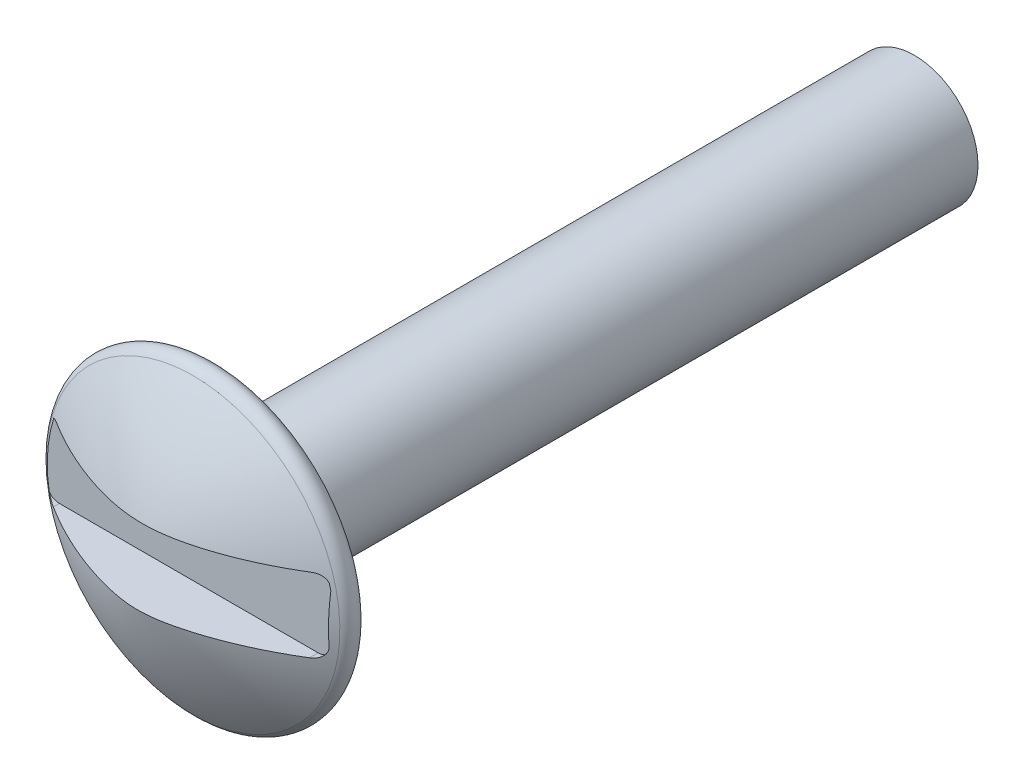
ISO-10303-21;
HEADER;
FILE_DESCRIPTION(('STEP AP214'),'2;1');
FILE_NAME('part.step','',(''),(''),'','','');
FILE_SCHEMA(('AUTOMOTIVE_DESIGN { 1 0 10303 214 1 1 1 1 }'));
ENDSEC;
DATA;
#1=APPLICATION_CONTEXT('core data for automotive mechanical design processes');
#2=APPLICATION_PROTOCOL_DEFINITION('international standard','automotive_design',2000,#1);
#3=PRODUCT_CONTEXT('',#1,'mechanical');
#4=PRODUCT('Part','Part','',(#3));
#5=PRODUCT_RELATED_PRODUCT_CATEGORY('part','',(#4));
#6=PRODUCT_DEFINITION_FORMATION('','',#4);
#7=PRODUCT_DEFINITION_CONTEXT('part definition',#1,'design');
#8=PRODUCT_DEFINITION('design','',#6,#7);
#9=PRODUCT_DEFINITION_SHAPE('','',#8);
#10=(LENGTH_UNIT() NAMED_UNIT(*) SI_UNIT(.MILLI.,.METRE.));
#11=(NAMED_UNIT(*) PLANE_ANGLE_UNIT() SI_UNIT($,.RADIAN.));
#12=(NAMED_UNIT(*) SI_UNIT($,.STERADIAN.) SOLID_ANGLE_UNIT());
#13=UNCERTAINTY_MEASURE_WITH_UNIT(LENGTH_MEASURE(1.E-05),#10,'distance_accuracy_value','');
#14=(GEOMETRIC_REPRESENTATION_CONTEXT(3) GLOBAL_UNCERTAINTY_ASSIGNED_CONTEXT((#13)) GLOBAL_UNIT_ASSIGNED_CONTEXT((#10,
#11,#12)) REPRESENTATION_CONTEXT('',''));
#15=CARTESIAN_POINT('',(0.,0.,0.));
#16=DIRECTION('',(0.,0.,1.));
#17=DIRECTION('',(1.,0.,0.));
#18=AXIS2_PLACEMENT_3D('',#15,#16,#17);
#19=CARTESIAN_POINT('',(0.,0.,55.));
#20=DIRECTION('',(0.,0.,-1.));
#21=DIRECTION('',(-1.,0.,0.));
#22=AXIS2_PLACEMENT_3D('',#19,#20,#21);
#23=CYLINDRICAL_SURFACE('',#22,5.);
#24=CARTESIAN_POINT('',(0.,0.,55.));
#25=DIRECTION('',(0.,0.,1.));
#26=DIRECTION('',(1.,0.,0.));
#27=AXIS2_PLACEMENT_3D('',#24,#25,#26);
#28=CIRCLE('',#27,5.);
#29=CARTESIAN_POINT('',(5.,0.,55.));
#30=VERTEX_POINT('',#29);
#31=EDGE_CURVE('E220',#30,#30,#28,.T.);
#32=ORIENTED_EDGE('',*,*,#31,.F.);
#33=EDGE_LOOP('',(#32));
#34=FACE_BOUND('',#33,.T.);
#35=CARTESIAN_POINT('',(0.,0.,0.));
#36=DIRECTION('',(0.,0.,1.));
#37=DIRECTION('',(1.,0.,0.));
#38=AXIS2_PLACEMENT_3D('',#35,#36,#37);
#39=CIRCLE('',#38,5.);
#40=CARTESIAN_POINT('',(5.,0.,0.));
#41=VERTEX_POINT('',#40);
#42=EDGE_CURVE('E223',#41,#41,#39,.T.);
#43=ORIENTED_EDGE('',*,*,#42,.T.);
#44=EDGE_LOOP('',(#43));
#45=FACE_BOUND('',#44,.T.);
#46=ADVANCED_FACE('F32',(#34,#45),#23,.T.);
#47=CARTESIAN_POINT('',(0.,0.,0.));
#48=DIRECTION('',(0.,0.,1.));
#49=DIRECTION('',(1.,0.,0.));
#50=AXIS2_PLACEMENT_3D('',#47,#48,#49);
#51=PLANE('',#50);
#52=ORIENTED_EDGE('',*,*,#42,.F.);
#53=EDGE_LOOP('',(#52));
#54=FACE_BOUND('',#53,.T.);
#55=ADVANCED_FACE('F154',(#54),#51,.F.);
#56=CARTESIAN_POINT('',(0.,0.,55.));
#57=DIRECTION('',(0.,0.,-1.));
#58=DIRECTION('',(-1.,0.,0.));
#59=AXIS2_PLACEMENT_3D('',#56,#57,#58);
#60=PLANE('',#59);
#61=CARTESIAN_POINT('',(0.,0.,55.));
#62=DIRECTION('',(0.,0.,-1.));
#63=DIRECTION('',(-1.,0.,0.));
#64=AXIS2_PLACEMENT_3D('',#61,#62,#63);
#65=CIRCLE('',#64,10.9901594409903);
#66=CARTESIAN_POINT('',(-10.9901594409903,0.,55.));
#67=VERTEX_POINT('',#66);
#68=EDGE_CURVE('E224',#67,#67,#65,.T.);
#69=ORIENTED_EDGE('',*,*,#68,.T.);
#70=EDGE_LOOP('',(#69));
#71=FACE_BOUND('',#70,.T.);
#72=ORIENTED_EDGE('',*,*,#31,.T.);
#73=EDGE_LOOP('',(#72));
#74=FACE_BOUND('',#73,.T.);
#75=ADVANCED_FACE('F151',(#71,#74),#60,.T.);
#76=CARTESIAN_POINT('',(0.,11.5642425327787,56.8187970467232));
#77=CARTESIAN_POINT('',(0.,8.07794332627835,59.2631456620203));
#78=CARTESIAN_POINT('',(0.,4.18300109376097,60.9035240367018));
#79=CARTESIAN_POINT('',(0.,0.,61.6895171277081));
#80=B_SPLINE_CURVE_WITH_KNOTS('',3,(#76,#77,#78,#79),.UNSPECIFIED.,.F.,.F.,(4,4),(0.,
0.812856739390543),.UNSPECIFIED.);
#81=CARTESIAN_POINT('',(0.,0.,49.7533353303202));
#82=DIRECTION('',(0.,0.,-1.));
#83=AXIS1_PLACEMENT('',#81,#82);
#84=SURFACE_OF_REVOLUTION('',#80,#83);
#85=CARTESIAN_POINT('',(10.0302950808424,-2.24099313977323,57.6728208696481));
#86=CARTESIAN_POINT('',(10.1027244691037,-2.24100761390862,57.6284671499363));
#87=CARTESIAN_POINT('',(10.175615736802,-2.23311010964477,57.5844784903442));
#88=CARTESIAN_POINT('',(10.3199524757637,-2.2010018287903,57.4986892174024));
#89=CARTESIAN_POINT('',(10.3913787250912,-2.17664308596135,57.4569121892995));
#90=CARTESIAN_POINT('',(10.5196299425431,-2.11556409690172,57.3832531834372));
#91=CARTESIAN_POINT('',(10.5771197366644,-2.08097495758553,57.3507981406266));
#92=CARTESIAN_POINT('',(10.6582586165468,-2.01996909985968,57.3059288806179));
#93=CARTESIAN_POINT('',(10.6844057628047,-1.99816900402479,57.2916341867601));
#94=CARTESIAN_POINT('',(10.73475419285,-1.95156661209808,57.2644617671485));
#95=CARTESIAN_POINT('',(10.7589534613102,-1.92676127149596,57.251585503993));
#96=CARTESIAN_POINT('',(10.814730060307,-1.86318687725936,57.2223935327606));
#97=CARTESIAN_POINT('',(10.8451035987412,-1.8229467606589,57.2069238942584));
#98=CARTESIAN_POINT('',(10.8998569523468,-1.73741626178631,57.1800196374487));
#99=CARTESIAN_POINT('',(10.9242443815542,-1.69213240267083,57.1685798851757));
#100=CARTESIAN_POINT('',(10.9661085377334,-1.59729943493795,57.150231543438));
#101=CARTESIAN_POINT('',(10.9835471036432,-1.54772854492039,57.1433478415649));
#102=CARTESIAN_POINT('',(11.0104438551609,-1.44607937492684,57.1346286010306));
#103=CARTESIAN_POINT('',(11.0199160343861,-1.39400566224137,57.1327841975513));
#104=CARTESIAN_POINT('',(11.0269143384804,-1.32487663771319,57.1337307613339));
#105=CARTESIAN_POINT('',(11.0281837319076,-1.30809200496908,57.1342222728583));
#106=CARTESIAN_POINT('',(11.029872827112,-1.2745322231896,57.1357219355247));
#107=CARTESIAN_POINT('',(11.0302939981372,-1.25775710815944,57.1367291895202));
#108=CARTESIAN_POINT('',(11.0302950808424,-1.24099313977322,57.1379913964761));
#109=B_SPLINE_CURVE_WITH_KNOTS('',3,(#85,#86,#87,#88,#89,#90,#91,#92,#93,#94,#95,#96,#97,#98,
#99,#100,#101,#102,#103,#104,#105,#106,#107,#108),.UNSPECIFIED.,.F.,.F.,(4,2,2,2,2,2,2,2,2,2,2,
4),(0.,0.254756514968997,0.511833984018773,0.733956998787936,0.844552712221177,
0.955261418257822,1.11275558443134,1.27004837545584,1.42819344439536,1.58606013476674,
1.63655848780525,1.68696929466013),.UNSPECIFIED.);
#110=CARTESIAN_POINT('',(10.0302950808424,-2.24099313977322,57.6728208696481));
#111=VERTEX_POINT('',#110);
#112=CARTESIAN_POINT('',(11.0302950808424,-1.24099313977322,57.1379913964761));
#113=VERTEX_POINT('',#112);
#114=EDGE_CURVE('E11',#111,#113,#109,.T.);
#115=ORIENTED_EDGE('',*,*,#114,.F.);
#116=CARTESIAN_POINT('',(-10.3450277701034,-2.24099313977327,57.477347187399));
#117=CARTESIAN_POINT('',(-10.2081855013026,-2.24099313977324,57.5635398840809));
#118=CARTESIAN_POINT('',(-10.070630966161,-2.24099313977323,57.6486023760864));
#119=CARTESIAN_POINT('',(-9.79411142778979,-2.24099313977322,57.8164371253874));
#120=CARTESIAN_POINT('',(-9.65514627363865,-2.24099313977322,57.8992091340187));
#121=CARTESIAN_POINT('',(-9.37584009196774,-2.24099313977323,58.0624197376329));
#122=CARTESIAN_POINT('',(-9.23549897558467,-2.24099313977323,58.142858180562));
#123=CARTESIAN_POINT('',(-8.95347613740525,-2.24099313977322,58.3013590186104));
#124=CARTESIAN_POINT('',(-8.81179437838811,-2.24099313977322,58.3794213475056));
#125=CARTESIAN_POINT('',(-8.52433162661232,-2.24099313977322,58.5346361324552));
#126=CARTESIAN_POINT('',(-8.37852475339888,-2.24099313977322,58.6117406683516));
#127=CARTESIAN_POINT('',(-8.08559007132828,-2.24099313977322,58.7633907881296));
#128=CARTESIAN_POINT('',(-7.93846228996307,-2.24099313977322,58.8379364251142));
#129=CARTESIAN_POINT('',(-7.6429210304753,-2.24099313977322,58.9844231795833));
#130=CARTESIAN_POINT('',(-7.49450759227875,-2.24099313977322,59.0563643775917));
#131=CARTESIAN_POINT('',(-7.19643048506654,-2.24099313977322,59.1975938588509));
#132=CARTESIAN_POINT('',(-7.04676685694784,-2.24099313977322,59.2668822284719));
#133=CARTESIAN_POINT('',(-6.68471239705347,-2.24099313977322,59.4305629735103));
#134=CARTESIAN_POINT('',(-6.47171775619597,-2.24099313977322,59.5236239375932));
#135=CARTESIAN_POINT('',(-6.04337764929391,-2.24099313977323,59.7042198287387));
#136=CARTESIAN_POINT('',(-5.82803198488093,-2.24099313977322,59.7917542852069));
#137=CARTESIAN_POINT('',(-5.39504907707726,-2.24099313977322,59.9610972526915));
#138=CARTESIAN_POINT('',(-5.17741138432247,-2.24099313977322,60.0429046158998));
#139=CARTESIAN_POINT('',(-4.73987819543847,-2.24099313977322,60.2005247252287));
#140=CARTESIAN_POINT('',(-4.51998186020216,-2.24099313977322,60.2763351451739));
#141=CARTESIAN_POINT('',(-4.08099382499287,-2.24099313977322,60.4205630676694));
#142=CARTESIAN_POINT('',(-3.86192994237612,-2.24099313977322,60.4890650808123));
#143=CARTESIAN_POINT('',(-3.42177951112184,-2.24099313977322,60.6192096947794));
#144=CARTESIAN_POINT('',(-3.20069308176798,-2.24099313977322,60.6808526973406));
#145=CARTESIAN_POINT('',(-2.75651203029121,-2.24099313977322,60.7963190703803));
#146=CARTESIAN_POINT('',(-2.53341771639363,-2.24099313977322,60.8501436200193));
#147=CARTESIAN_POINT('',(-2.08505013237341,-2.24099313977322,60.9484219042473));
#148=CARTESIAN_POINT('',(-1.85977609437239,-2.24099313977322,60.9928722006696));
#149=CARTESIAN_POINT('',(-1.46572325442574,-2.24099313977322,61.0597949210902));
#150=CARTESIAN_POINT('',(-1.29740889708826,-2.24099313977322,61.0849781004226));
#151=CARTESIAN_POINT('',(-0.959817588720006,-2.24099313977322,61.1272454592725));
#152=CARTESIAN_POINT('',(-0.79054111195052,-2.24099313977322,61.1443333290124));
#153=CARTESIAN_POINT('',(-0.451486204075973,-2.24099313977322,61.1689005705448));
#154=CARTESIAN_POINT('',(-0.281708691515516,-2.24099313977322,61.176392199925));
#155=CARTESIAN_POINT('',(0.0578063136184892,-2.24099313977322,61.1809329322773));
#156=CARTESIAN_POINT('',(0.227543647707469,-2.24099313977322,61.1779934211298));
#157=CARTESIAN_POINT('',(0.568259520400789,-2.24099313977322,61.1619750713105));
#158=CARTESIAN_POINT('',(0.739233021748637,-2.24099313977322,61.1487929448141));
#159=CARTESIAN_POINT('',(1.08046960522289,-2.24099313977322,61.1135071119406));
#160=CARTESIAN_POINT('',(1.25073136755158,-2.24099313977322,61.0913910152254));
#161=CARTESIAN_POINT('',(1.59038748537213,-2.24099313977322,61.0397851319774));
#162=CARTESIAN_POINT('',(1.75978005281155,-2.24099313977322,61.0102837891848));
#163=CARTESIAN_POINT('',(2.09750699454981,-2.24099313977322,60.9452119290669));
#164=CARTESIAN_POINT('',(2.26584051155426,-2.24099313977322,60.9096370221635));
#165=CARTESIAN_POINT('',(2.70645974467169,-2.24099313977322,60.8095248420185));
#166=CARTESIAN_POINT('',(2.97779605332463,-2.24099313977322,60.7408064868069));
#167=CARTESIAN_POINT('',(3.51722808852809,-2.24099313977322,60.5925226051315));
#168=CARTESIAN_POINT('',(3.78532610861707,-2.24099313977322,60.5129653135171));
#169=CARTESIAN_POINT('',(4.31846254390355,-2.24099313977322,60.3442848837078));
#170=CARTESIAN_POINT('',(4.58350122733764,-2.24099313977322,60.2551625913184));
#171=CARTESIAN_POINT('',(5.11048403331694,-2.24099313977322,60.068117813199));
#172=CARTESIAN_POINT('',(5.37242777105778,-2.24099313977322,59.9701942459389));
#173=CARTESIAN_POINT('',(5.89309525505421,-2.24099313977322,59.7660367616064));
#174=CARTESIAN_POINT('',(6.15181854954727,-2.24099313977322,59.6598016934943));
#175=CARTESIAN_POINT('',(6.65927577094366,-2.24099313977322,59.4422055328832));
#176=CARTESIAN_POINT('',(6.90809588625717,-2.24099313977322,59.3310452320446));
#177=CARTESIAN_POINT('',(7.40230194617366,-2.24099313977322,59.1014541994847));
#178=CARTESIAN_POINT('',(7.6476885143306,-2.24099313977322,58.9830248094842));
#179=CARTESIAN_POINT('',(8.13477750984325,-2.24099313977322,58.7391660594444));
#180=CARTESIAN_POINT('',(8.37648201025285,-2.24099313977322,58.6137408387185));
#181=CARTESIAN_POINT('',(8.85595462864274,-2.24099313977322,58.3561579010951));
#182=CARTESIAN_POINT('',(9.0937265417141,-2.24099313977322,58.2240072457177));
#183=CARTESIAN_POINT('',(9.56508681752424,-2.24099313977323,57.9532473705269));
#184=CARTESIAN_POINT('',(9.79868095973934,-2.24099313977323,57.8146482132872));
#185=CARTESIAN_POINT('',(10.0302950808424,-2.24099313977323,57.6728208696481));
#186=B_SPLINE_CURVE_WITH_KNOTS('',3,(#116,#117,#118,#119,#120,#121,#122,#123,#124,#125,#126,
#127,#128,#129,#130,#131,#132,#133,#134,#135,#136,#137,#138,#139,#140,#141,#142,#143,#144,#145,
#146,#147,#148,#149,#150,#151,#152,#153,#154,#155,#156,#157,#158,#159,#160,#161,#162,#163,#164,
#165,#166,#167,#168,#169,#170,#171,#172,#173,#174,#175,#176,#177,#178,#179,#180,#181,#182,#183,
#184,#185),.UNSPECIFIED.,.F.,.F.,(4,2,2,2,2,2,2,2,2,2,2,2,2,2,2,2,2,2,2,2,2,2,2,2,2,2,2,2,2,2,2,
2,2,2,4),(0.,0.48517007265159,0.970392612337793,1.45564669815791,1.94091429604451,
2.43570513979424,2.93048570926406,3.42525096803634,3.92000010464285,4.6172319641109,
5.31452311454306,6.01195361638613,6.70965333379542,7.39812616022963,8.08655864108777,
8.77488718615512,9.46346775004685,9.97387651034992,10.484052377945,10.9935759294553,
11.5025434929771,12.0167112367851,12.5315945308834,13.0472885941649,13.5633569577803,
14.4027622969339,15.2415334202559,16.0802304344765,16.9190306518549,17.7579472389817,
18.575392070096,19.3926864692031,20.2095023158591,21.0254775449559,21.8402196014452),.UNSPECIFIED.);
#187=CARTESIAN_POINT('',(-10.3450277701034,-2.24099313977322,57.477347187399));
#188=VERTEX_POINT('',#187);
#189=EDGE_CURVE('E44',#188,#111,#186,.T.);
#190=ORIENTED_EDGE('',*,*,#189,.F.);
#191=CARTESIAN_POINT('',(-11.1539558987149,-1.82890068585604,57.));
#192=CARTESIAN_POINT('',(-11.1194214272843,-1.87645931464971,57.0180915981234));
#193=CARTESIAN_POINT('',(-11.0812490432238,-1.92014288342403,57.0387594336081));
#194=CARTESIAN_POINT('',(-10.9995687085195,-1.99912584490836,57.0840834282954));
#195=CARTESIAN_POINT('',(-10.9560972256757,-2.0344781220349,57.1087126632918));
#196=CARTESIAN_POINT('',(-10.8654329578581,-2.09667919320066,57.160960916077));
#197=CARTESIAN_POINT('',(-10.818254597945,-2.12355909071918,57.1885684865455));
#198=CARTESIAN_POINT('',(-10.7212313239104,-2.16908122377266,57.2460981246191));
#199=CARTESIAN_POINT('',(-10.6713797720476,-2.18770177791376,57.2760260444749));
#200=CARTESIAN_POINT('',(-10.5754206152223,-2.21523822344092,57.3342847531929));
#201=CARTESIAN_POINT('',(-10.5294471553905,-2.22494783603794,57.3624689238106));
#202=CARTESIAN_POINT('',(-10.4372803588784,-2.23780917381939,57.4194957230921));
#203=CARTESIAN_POINT('',(-10.39108895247,-2.24099031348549,57.448334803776));
#204=CARTESIAN_POINT('',(-10.3450277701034,-2.24099313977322,57.477347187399));
#205=B_SPLINE_CURVE_WITH_KNOTS('',3,(#191,#192,#193,#194,#195,#196,#197,#198,#199,#200,#201,
#202,#203,#204),.UNSPECIFIED.,.F.,.F.,(4,2,2,2,2,2,4),(0.,0.183929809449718,0.366658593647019,
0.548708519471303,0.731233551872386,0.895215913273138,1.05845780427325),.UNSPECIFIED.);
#206=CARTESIAN_POINT('',(-11.1539558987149,-1.82890068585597,57.));
#207=VERTEX_POINT('',#206);
#208=EDGE_CURVE('E110',#207,#188,#205,.T.);
#209=ORIENTED_EDGE('',*,*,#208,.F.);
#210=CARTESIAN_POINT('',(0.,0.,57.));
#211=DIRECTION('',(0.,0.,-1.));
#212=DIRECTION('',(-1.,0.,0.));
#213=AXIS2_PLACEMENT_3D('',#210,#211,#212);
#214=CIRCLE('',#213,11.3029027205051);
#215=CARTESIAN_POINT('',(-10.7890090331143,3.36940558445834,57.));
#216=VERTEX_POINT('',#215);
#217=EDGE_CURVE('E102',#216,#207,#214,.F.);
#218=ORIENTED_EDGE('',*,*,#217,.F.);
#219=CARTESIAN_POINT('',(-10.3450277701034,3.47336951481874,57.2632014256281));
#220=CARTESIAN_POINT('',(-10.4066102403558,3.47340252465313,57.2244897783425));
#221=CARTESIAN_POINT('',(-10.468791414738,3.46767609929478,57.1862857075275));
#222=CARTESIAN_POINT('',(-10.5912029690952,3.44455191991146,57.1128809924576));
#223=CARTESIAN_POINT('',(-10.6514484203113,3.42736142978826,57.0776393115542));
#224=CARTESIAN_POINT('',(-10.7235456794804,3.39907314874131,57.0366320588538));
#225=CARTESIAN_POINT('',(-10.7367206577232,3.39357717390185,57.0291878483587));
#226=CARTESIAN_POINT('',(-10.7629637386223,3.38195957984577,57.0144610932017));
#227=CARTESIAN_POINT('',(-10.7760311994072,3.37583553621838,57.0071793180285));
#228=CARTESIAN_POINT('',(-10.7890090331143,3.36940558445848,57.));
#229=B_SPLINE_CURVE_WITH_KNOTS('',3,(#219,#220,#221,#222,#223,#224,#225,#226,#227,#228),
.UNSPECIFIED.,.F.,.F.,(4,2,2,2,4),(0.,0.21840244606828,0.432959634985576,0.48124941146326,
0.529733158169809),.UNSPECIFIED.);
#230=CARTESIAN_POINT('',(-10.3450277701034,3.47336951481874,57.2632014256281));
#231=VERTEX_POINT('',#230);
#232=EDGE_CURVE('E180',#231,#216,#229,.T.);
#233=ORIENTED_EDGE('',*,*,#232,.F.);
#234=CARTESIAN_POINT('',(10.0302950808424,3.47336951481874,57.4581864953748));
#235=CARTESIAN_POINT('',(9.84583517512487,3.47336951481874,57.5708112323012));
#236=CARTESIAN_POINT('',(9.66008953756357,3.47336951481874,57.6813336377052));
#237=CARTESIAN_POINT('',(9.28606907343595,3.47336951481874,57.8980676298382));
#238=CARTESIAN_POINT('',(9.09779393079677,3.47336951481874,58.0042786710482));
#239=CARTESIAN_POINT('',(8.71879494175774,3.47336951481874,58.2122598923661));
#240=CARTESIAN_POINT('',(8.52807098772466,3.47336951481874,58.3140298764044));
#241=CARTESIAN_POINT('',(8.14086022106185,3.47336951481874,58.5147512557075));
#242=CARTESIAN_POINT('',(7.94433112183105,3.47336951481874,58.6136211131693));
#243=CARTESIAN_POINT('',(7.54889339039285,3.47336951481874,58.806468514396));
#244=CARTESIAN_POINT('',(7.34998483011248,3.47336951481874,58.9004462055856));
#245=CARTESIAN_POINT('',(6.94985640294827,3.47336951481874,59.083340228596));
#246=CARTESIAN_POINT('',(6.74863656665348,3.47336951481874,59.1722566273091));
#247=CARTESIAN_POINT('',(6.3355895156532,3.47336951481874,59.3483949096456));
#248=CARTESIAN_POINT('',(6.12366757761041,3.47336951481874,59.4353949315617));
#249=CARTESIAN_POINT('',(5.69744281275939,3.47336951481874,59.6034212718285));
#250=CARTESIAN_POINT('',(5.48313976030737,3.47336951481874,59.684447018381));
#251=CARTESIAN_POINT('',(5.05218901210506,3.47336951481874,59.8401796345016));
#252=CARTESIAN_POINT('',(4.83554077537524,3.47336951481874,59.9148850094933));
#253=CARTESIAN_POINT('',(4.39989580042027,3.47336951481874,60.0575244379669));
#254=CARTESIAN_POINT('',(4.18089789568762,3.47336951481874,60.1254549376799));
#255=CARTESIAN_POINT('',(3.74315382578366,3.47336951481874,60.2531547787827));
#256=CARTESIAN_POINT('',(3.52443164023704,3.47336951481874,60.3130060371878));
#257=CARTESIAN_POINT('',(3.08493441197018,3.47336951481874,60.4245757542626));
#258=CARTESIAN_POINT('',(2.86415958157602,3.47336951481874,60.4762950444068));
#259=CARTESIAN_POINT('',(2.4207484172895,3.47336951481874,60.5704555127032));
#260=CARTESIAN_POINT('',(2.19811315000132,3.47336951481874,60.6129016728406));
#261=CARTESIAN_POINT('',(1.7511089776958,3.47336951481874,60.6871075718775));
#262=CARTESIAN_POINT('',(1.52674061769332,3.47336951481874,60.7188705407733));
#263=CARTESIAN_POINT('',(1.11216765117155,3.47336951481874,60.7660897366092));
#264=CARTESIAN_POINT('',(0.922167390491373,3.47336951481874,60.7833296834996));
#265=CARTESIAN_POINT('',(0.541507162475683,3.47336951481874,60.8083089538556));
#266=CARTESIAN_POINT('',(0.350847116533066,3.47336951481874,60.8160471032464));
#267=CARTESIAN_POINT('',(-0.0305858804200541,3.47336951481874,60.8215875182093));
#268=CARTESIAN_POINT('',(-0.221358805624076,3.47336951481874,60.819391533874));
#269=CARTESIAN_POINT('',(-0.602462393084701,3.47336951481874,60.8051971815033));
#270=CARTESIAN_POINT('',(-0.792793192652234,3.47336951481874,60.7932024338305));
#271=CARTESIAN_POINT('',(-1.1746266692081,3.47336951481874,60.759871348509));
#272=CARTESIAN_POINT('',(-1.36612081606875,3.47336951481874,60.7384387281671));
#273=CARTESIAN_POINT('',(-1.74802571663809,3.47336951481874,60.6871349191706));
#274=CARTESIAN_POINT('',(-1.93843608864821,3.47336951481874,60.657260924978));
#275=CARTESIAN_POINT('',(-2.3180275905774,3.47336951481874,60.5900257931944));
#276=CARTESIAN_POINT('',(-2.50720798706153,3.47336951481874,60.5526605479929));
#277=CARTESIAN_POINT('',(-2.88417181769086,3.47336951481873,60.4712939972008));
#278=CARTESIAN_POINT('',(-3.07195489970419,3.47336951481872,60.4272910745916));
#279=CARTESIAN_POINT('',(-3.57716294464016,3.47336951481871,60.3004365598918));
#280=CARTESIAN_POINT('',(-3.89318667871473,3.47336951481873,60.211975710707));
#281=CARTESIAN_POINT('',(-4.52068525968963,3.47336951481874,60.0203879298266));
#282=CARTESIAN_POINT('',(-4.83216039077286,3.47336951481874,59.9172619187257));
#283=CARTESIAN_POINT('',(-5.45055552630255,3.47336951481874,59.6978275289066));
#284=CARTESIAN_POINT('',(-5.75747373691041,3.47336951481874,59.5815141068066));
#285=CARTESIAN_POINT('',(-6.36653933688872,3.47336951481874,59.336727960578));
#286=CARTESIAN_POINT('',(-6.66868496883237,3.47336951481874,59.2082508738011));
#287=CARTESIAN_POINT('',(-7.26033026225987,3.47336951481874,58.9432858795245));
#288=CARTESIAN_POINT('',(-7.54995682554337,3.47336951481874,58.8070808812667));
#289=CARTESIAN_POINT('',(-8.12402110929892,3.47336951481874,58.5244367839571));
#290=CARTESIAN_POINT('',(-8.40846090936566,3.47336951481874,58.3780019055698));
#291=CARTESIAN_POINT('',(-8.97173354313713,3.47336951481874,58.075465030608));
#292=CARTESIAN_POINT('',(-9.25057234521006,3.47336951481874,57.9193741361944));
#293=CARTESIAN_POINT('',(-9.80222281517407,3.47336951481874,57.5980779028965));
#294=CARTESIAN_POINT('',(-10.075045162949,3.47336951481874,57.4328909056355));
#295=CARTESIAN_POINT('',(-10.3450277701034,3.47336951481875,57.2632014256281));
#296=B_SPLINE_CURVE_WITH_KNOTS('',3,(#234,#235,#236,#237,#238,#239,#240,#241,#242,#243,#244,
#245,#246,#247,#248,#249,#250,#251,#252,#253,#254,#255,#256,#257,#258,#259,#260,#261,#262,#263,
#264,#265,#266,#267,#268,#269,#270,#271,#272,#273,#274,#275,#276,#277,#278,#279,#280,#281,#282,
#283,#284,#285,#286,#287,#288,#289,#290,#291,#292,#293,#294,#295),.UNSPECIFIED.,.F.,.F.,(4,2,2,
2,2,2,2,2,2,2,2,2,2,2,2,2,2,2,2,2,2,2,2,2,2,2,2,2,2,2,4),(0.,0.648362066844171,1.29680591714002,
1.94527836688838,2.60520505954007,3.26511185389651,3.92500992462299,4.61217743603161,
5.29941063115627,5.98680588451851,6.6745598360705,7.35471093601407,8.03479244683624,
8.71450768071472,9.39401722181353,9.96614415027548,10.5383417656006,11.1104385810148,
11.6823241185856,12.2601841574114,12.8382364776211,13.4166066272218,13.99511790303,
14.9791802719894,15.963180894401,16.9475591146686,17.932291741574,18.8922466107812,
19.8518077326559,20.8102853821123,21.7668964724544),.UNSPECIFIED.);
#297=CARTESIAN_POINT('',(10.0302950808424,3.47336951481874,57.4581864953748));
#298=VERTEX_POINT('',#297);
#299=EDGE_CURVE('E59',#298,#231,#296,.T.);
#300=ORIENTED_EDGE('',*,*,#299,.F.);
#301=CARTESIAN_POINT('',(10.9129111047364,2.94346413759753,57.));
#302=CARTESIAN_POINT('',(10.9002214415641,2.96729290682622,57.0041457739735));
#303=CARTESIAN_POINT('',(10.8866193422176,2.9905009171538,57.0089399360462));
#304=CARTESIAN_POINT('',(10.8577522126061,3.035534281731,57.0197479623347));
#305=CARTESIAN_POINT('',(10.842488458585,3.05736067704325,57.0257608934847));
#306=CARTESIAN_POINT('',(10.7946350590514,3.12032102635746,57.0454333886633));
#307=CARTESIAN_POINT('',(10.7598056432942,3.15926489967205,57.0607854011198));
#308=CARTESIAN_POINT('',(10.6857037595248,3.23038739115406,57.095213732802));
#309=CARTESIAN_POINT('',(10.6464439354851,3.26258454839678,57.1142795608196));
#310=CARTESIAN_POINT('',(10.5645821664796,3.32015483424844,57.1554783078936));
#311=CARTESIAN_POINT('',(10.5219746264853,3.34551621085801,57.1776164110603));
#312=CARTESIAN_POINT('',(10.4299744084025,3.39161549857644,57.2267316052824));
#313=CARTESIAN_POINT('',(10.3803396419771,3.41158557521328,57.2539727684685));
#314=CARTESIAN_POINT('',(10.2797077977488,3.4432024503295,57.3105566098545));
#315=CARTESIAN_POINT('',(10.2287112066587,3.45485218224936,57.3398985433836));
#316=CARTESIAN_POINT('',(10.1284681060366,3.46977446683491,57.3988017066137));
#317=CARTESIAN_POINT('',(10.0792357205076,3.47337136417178,57.4283044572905));
#318=CARTESIAN_POINT('',(10.0302950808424,3.47336951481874,57.4581864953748));
#319=B_SPLINE_CURVE_WITH_KNOTS('',3,(#301,#302,#303,#304,#305,#306,#307,#308,#309,#310,#311,
#312,#313,#314,#315,#316,#317,#318),.UNSPECIFIED.,.F.,.F.,(4,2,2,2,2,2,2,2,4),(0.,
0.0818760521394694,0.163689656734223,0.326198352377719,0.488254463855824,0.650587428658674,
0.830010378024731,1.00937003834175,1.18136474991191),.UNSPECIFIED.);
#320=CARTESIAN_POINT('',(10.9129111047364,2.94346413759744,57.));
#321=VERTEX_POINT('',#320);
#322=EDGE_CURVE('E167',#321,#298,#319,.T.);
#323=ORIENTED_EDGE('',*,*,#322,.F.);
#324=CARTESIAN_POINT('',(11.0302950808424,2.46742787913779,57.));
#325=VERTEX_POINT('',#324);
#326=EDGE_CURVE('E226',#325,#321,#214,.F.);
#327=ORIENTED_EDGE('',*,*,#326,.F.);
#328=CARTESIAN_POINT('',(11.0302950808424,-1.24099313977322,57.1379913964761));
#329=CARTESIAN_POINT('',(11.0302950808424,-1.11700943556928,57.1473324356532));
#330=CARTESIAN_POINT('',(11.0302950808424,-0.992920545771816,57.1552803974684));
#331=CARTESIAN_POINT('',(11.0302950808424,-0.744845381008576,57.1683643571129));
#332=CARTESIAN_POINT('',(11.0302950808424,-0.620859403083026,57.1735059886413));
#333=CARTESIAN_POINT('',(11.0302950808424,-0.372990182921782,57.1809835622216));
#334=CARTESIAN_POINT('',(11.0302950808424,-0.249107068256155,57.1833237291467));
#335=CARTESIAN_POINT('',(11.0302950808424,-0.00144392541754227,57.1852067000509));
#336=CARTESIAN_POINT('',(11.0302950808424,0.122336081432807,57.1847523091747));
#337=CARTESIAN_POINT('',(11.0302950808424,0.369792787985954,57.1810545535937));
#338=CARTESIAN_POINT('',(11.0302950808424,0.493469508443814,57.1778125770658));
#339=CARTESIAN_POINT('',(11.0302950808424,0.740715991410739,57.1685487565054));
#340=CARTESIAN_POINT('',(11.0302950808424,0.864285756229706,57.1625269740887));
#341=CARTESIAN_POINT('',(11.0302950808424,1.11132248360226,57.1477128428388));
#342=CARTESIAN_POINT('',(11.0302950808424,1.23478936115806,57.1389190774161));
#343=CARTESIAN_POINT('',(11.0302950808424,1.48162119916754,57.1185705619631));
#344=CARTESIAN_POINT('',(11.0302950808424,1.60498592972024,57.1070130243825));
#345=CARTESIAN_POINT('',(11.0302950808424,1.85161427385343,57.0811462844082));
#346=CARTESIAN_POINT('',(11.0302950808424,1.97487745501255,57.0668329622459));
#347=CARTESIAN_POINT('',(11.0302950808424,2.22130414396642,57.0354650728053));
#348=CARTESIAN_POINT('',(11.0302950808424,2.34446696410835,57.0184051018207));
#349=CARTESIAN_POINT('',(11.0302950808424,2.46742787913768,57.));
#350=B_SPLINE_CURVE_WITH_KNOTS('',3,(#328,#329,#330,#331,#332,#333,#334,#335,#336,#337,#338,
#339,#340,#341,#342,#343,#344,#345,#346,#347,#348,#349),.UNSPECIFIED.,.F.,.F.,(4,2,2,2,2,2,2,2,
2,2,4),(0.,0.372997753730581,0.745243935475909,1.11692802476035,1.48823908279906,
1.85936534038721,2.23048337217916,2.60179136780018,2.97347545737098,3.34571957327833,
3.71870519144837),.UNSPECIFIED.);
#351=EDGE_CURVE('E158',#113,#325,#350,.T.);
#352=ORIENTED_EDGE('',*,*,#351,.F.);
#353=EDGE_LOOP('',(#115,#190,#209,#218,#233,#300,#323,#327,#352));
#354=FACE_BOUND('',#353,.T.);
#355=CARTESIAN_POINT('',(0.,0.,56.8187970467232));
#356=DIRECTION('',(0.,0.,-1.));
#357=DIRECTION('',(-1.,0.,0.));
#358=AXIS2_PLACEMENT_3D('',#355,#356,#357);
#359=CIRCLE('',#358,11.5642425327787);
#360=CARTESIAN_POINT('',(-11.5642425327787,0.,56.8187970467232));
#361=VERTEX_POINT('',#360);
#362=EDGE_CURVE('E131',#361,#361,#359,.T.);
#363=ORIENTED_EDGE('',*,*,#362,.F.);
#364=EDGE_LOOP('',(#363));
#365=FACE_BOUND('',#364,.T.);
#366=ADVANCED_FACE('F146',(#354,#365),#84,.F.);
#367=CARTESIAN_POINT('',(0.,0.,56.));
#368=DIRECTION('',(0.,0.,-1.));
#369=DIRECTION('',(-1.,0.,0.));
#370=AXIS2_PLACEMENT_3D('',#367,#368,#369);
#371=TOROIDAL_SURFACE('',#370,10.9901594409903,1.);
#372=ORIENTED_EDGE('',*,*,#362,.T.);
#373=EDGE_LOOP('',(#372));
#374=FACE_BOUND('',#373,.T.);
#375=ORIENTED_EDGE('',*,*,#68,.F.);
#376=EDGE_LOOP('',(#375));
#377=FACE_BOUND('',#376,.T.);
#378=ADVANCED_FACE('F150',(#374,#377),#371,.T.);
#379=CARTESIAN_POINT('',(-10.3450277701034,2.47336951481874,57.));
#380=DIRECTION('',(0.,0.,1.));
#381=DIRECTION('',(1.,0.,0.));
#382=AXIS2_PLACEMENT_3D('',#379,#380,#381);
#383=CYLINDRICAL_SURFACE('',#382,1.);
#384=ORIENTED_EDGE('',*,*,#232,.T.);
#385=CARTESIAN_POINT('',(-10.3450277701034,2.47336951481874,57.));
#386=DIRECTION('',(0.,0.,1.));
#387=DIRECTION('',(-1.,0.,0.));
#388=AXIS2_PLACEMENT_3D('',#385,#386,#387);
#389=CIRCLE('',#388,1.);
#390=CARTESIAN_POINT('',(-10.3450277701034,3.47336951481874,57.));
#391=VERTEX_POINT('',#390);
#392=EDGE_CURVE('E105',#391,#216,#389,.T.);
#393=ORIENTED_EDGE('',*,*,#392,.F.);
#394=DIRECTION('',(0.,0.,1.));
#395=VECTOR('',#394,1.);
#396=CARTESIAN_POINT('',(-10.3450277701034,3.47336951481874,57.));
#397=LINE('',#396,#395);
#398=EDGE_CURVE('E129',#391,#231,#397,.T.);
#399=ORIENTED_EDGE('',*,*,#398,.T.);
#400=EDGE_LOOP('',(#384,#393,#399));
#401=FACE_BOUND('',#400,.T.);
#402=ADVANCED_FACE('F200',(#401),#383,.F.);
#403=CARTESIAN_POINT('',(10.0302950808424,3.47336951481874,57.));
#404=DIRECTION('',(0.,1.,0.));
#405=DIRECTION('',(0.,0.,1.));
#406=AXIS2_PLACEMENT_3D('',#403,#404,#405);
#407=PLANE('',#406);
#408=ORIENTED_EDGE('',*,*,#299,.T.);
#409=ORIENTED_EDGE('',*,*,#398,.F.);
#410=DIRECTION('',(-1.,0.,0.));
#411=VECTOR('',#410,1.);
#412=CARTESIAN_POINT('',(10.0302950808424,3.47336951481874,57.));
#413=LINE('',#412,#411);
#414=CARTESIAN_POINT('',(10.0302950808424,3.47336951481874,57.));
#415=VERTEX_POINT('',#414);
#416=EDGE_CURVE('E114',#415,#391,#413,.T.);
#417=ORIENTED_EDGE('',*,*,#416,.F.);
#418=DIRECTION('',(0.,0.,1.));
#419=VECTOR('',#418,1.);
#420=CARTESIAN_POINT('',(10.0302950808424,3.47336951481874,57.));
#421=LINE('',#420,#419);
#422=EDGE_CURVE('E132',#415,#298,#421,.T.);
#423=ORIENTED_EDGE('',*,*,#422,.T.);
#424=EDGE_LOOP('',(#408,#409,#417,#423));
#425=FACE_BOUND('',#424,.T.);
#426=ADVANCED_FACE('F203',(#425),#407,.F.);
#427=CARTESIAN_POINT('',(10.0302950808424,2.47336951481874,57.));
#428=DIRECTION('',(0.,0.,1.));
#429=DIRECTION('',(1.,0.,0.));
#430=AXIS2_PLACEMENT_3D('',#427,#428,#429);
#431=CYLINDRICAL_SURFACE('',#430,1.);
#432=ORIENTED_EDGE('',*,*,#322,.T.);
#433=ORIENTED_EDGE('',*,*,#422,.F.);
#434=CARTESIAN_POINT('',(10.0302950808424,2.47336951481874,57.));
#435=DIRECTION('',(0.,0.,1.));
#436=DIRECTION('',(-1.,0.,0.));
#437=AXIS2_PLACEMENT_3D('',#434,#435,#436);
#438=CIRCLE('',#437,1.);
#439=EDGE_CURVE('E125',#321,#415,#438,.T.);
#440=ORIENTED_EDGE('',*,*,#439,.F.);
#441=EDGE_LOOP('',(#432,#433,#440));
#442=FACE_BOUND('',#441,.T.);
#443=ADVANCED_FACE('F236',(#442),#431,.F.);
#444=CARTESIAN_POINT('',(11.0302950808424,2.47336951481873,57.));
#445=DIRECTION('',(1.,0.,0.));
#446=DIRECTION('',(0.,0.,-1.));
#447=AXIS2_PLACEMENT_3D('',#444,#445,#446);
#448=PLANE('',#447);
#449=ORIENTED_EDGE('',*,*,#351,.T.);
#450=DIRECTION('',(0.,1.,0.));
#451=VECTOR('',#450,1.);
#452=CARTESIAN_POINT('',(11.0302950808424,2.47336951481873,57.));
#453=LINE('',#452,#451);
#454=CARTESIAN_POINT('',(11.0302950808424,-1.24099313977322,57.));
#455=VERTEX_POINT('',#454);
#456=EDGE_CURVE('E51',#455,#325,#453,.T.);
#457=ORIENTED_EDGE('',*,*,#456,.F.);
#458=DIRECTION('',(0.,0.,1.));
#459=VECTOR('',#458,1.);
#460=CARTESIAN_POINT('',(11.0302950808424,-1.24099313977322,57.));
#461=LINE('',#460,#459);
#462=EDGE_CURVE('E134',#455,#113,#461,.T.);
#463=ORIENTED_EDGE('',*,*,#462,.T.);
#464=EDGE_LOOP('',(#449,#457,#463));
#465=FACE_BOUND('',#464,.T.);
#466=ADVANCED_FACE('F243',(#465),#448,.F.);
#467=CARTESIAN_POINT('',(10.0302950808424,-1.24099313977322,57.));
#468=DIRECTION('',(0.,0.,1.));
#469=DIRECTION('',(1.,0.,0.));
#470=AXIS2_PLACEMENT_3D('',#467,#468,#469);
#471=CYLINDRICAL_SURFACE('',#470,1.);
#472=ORIENTED_EDGE('',*,*,#114,.T.);
#473=ORIENTED_EDGE('',*,*,#462,.F.);
#474=CARTESIAN_POINT('',(10.0302950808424,-1.24099313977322,57.));
#475=DIRECTION('',(0.,0.,1.));
#476=DIRECTION('',(1.,0.,0.));
#477=AXIS2_PLACEMENT_3D('',#474,#475,#476);
#478=CIRCLE('',#477,1.);
#479=CARTESIAN_POINT('',(10.0302950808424,-2.24099313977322,57.));
#480=VERTEX_POINT('',#479);
#481=EDGE_CURVE('E119',#480,#455,#478,.T.);
#482=ORIENTED_EDGE('',*,*,#481,.F.);
#483=DIRECTION('',(0.,0.,1.));
#484=VECTOR('',#483,1.);
#485=CARTESIAN_POINT('',(10.0302950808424,-2.24099313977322,57.));
#486=LINE('',#485,#484);
#487=EDGE_CURVE('E113',#480,#111,#486,.T.);
#488=ORIENTED_EDGE('',*,*,#487,.T.);
#489=EDGE_LOOP('',(#472,#473,#482,#488));
#490=FACE_BOUND('',#489,.T.);
#491=ADVANCED_FACE('F196',(#490),#471,.F.);
#492=CARTESIAN_POINT('',(10.0302950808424,-2.24099313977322,57.));
#493=DIRECTION('',(0.,-1.,0.));
#494=DIRECTION('',(0.,0.,-1.));
#495=AXIS2_PLACEMENT_3D('',#492,#493,#494);
#496=PLANE('',#495);
#497=ORIENTED_EDGE('',*,*,#189,.T.);
#498=ORIENTED_EDGE('',*,*,#487,.F.);
#499=DIRECTION('',(1.,0.,0.));
#500=VECTOR('',#499,1.);
#501=CARTESIAN_POINT('',(10.0302950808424,-2.24099313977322,57.));
#502=LINE('',#501,#500);
#503=CARTESIAN_POINT('',(-10.3450277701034,-2.24099313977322,57.));
#504=VERTEX_POINT('',#503);
#505=EDGE_CURVE('E99',#504,#480,#502,.T.);
#506=ORIENTED_EDGE('',*,*,#505,.F.);
#507=DIRECTION('',(0.,0.,1.));
#508=VECTOR('',#507,1.);
#509=CARTESIAN_POINT('',(-10.3450277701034,-2.24099313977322,57.));
#510=LINE('',#509,#508);
#511=EDGE_CURVE('E108',#504,#188,#510,.T.);
#512=ORIENTED_EDGE('',*,*,#511,.T.);
#513=EDGE_LOOP('',(#497,#498,#506,#512));
#514=FACE_BOUND('',#513,.T.);
#515=ADVANCED_FACE('F116',(#514),#496,.F.);
#516=CARTESIAN_POINT('',(-10.3450277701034,-1.24099313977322,57.));
#517=DIRECTION('',(0.,0.,1.));
#518=DIRECTION('',(1.,0.,0.));
#519=AXIS2_PLACEMENT_3D('',#516,#517,#518);
#520=CYLINDRICAL_SURFACE('',#519,1.);
#521=ORIENTED_EDGE('',*,*,#208,.T.);
#522=ORIENTED_EDGE('',*,*,#511,.F.);
#523=CARTESIAN_POINT('',(-10.3450277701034,-1.24099313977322,57.));
#524=DIRECTION('',(0.,0.,1.));
#525=DIRECTION('',(1.,0.,0.));
#526=AXIS2_PLACEMENT_3D('',#523,#524,#525);
#527=CIRCLE('',#526,1.);
#528=EDGE_CURVE('E95',#207,#504,#527,.T.);
#529=ORIENTED_EDGE('',*,*,#528,.F.);
#530=EDGE_LOOP('',(#521,#522,#529));
#531=FACE_BOUND('',#530,.T.);
#532=ADVANCED_FACE('F109',(#531),#520,.F.);
#533=CARTESIAN_POINT('',(-10.3450277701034,2.47336951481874,57.));
#534=DIRECTION('',(0.,0.,-1.));
#535=DIRECTION('',(-1.,0.,0.));
#536=AXIS2_PLACEMENT_3D('',#533,#534,#535);
#537=PLANE('',#536);
#538=ORIENTED_EDGE('',*,*,#217,.T.);
#539=ORIENTED_EDGE('',*,*,#528,.T.);
#540=ORIENTED_EDGE('',*,*,#505,.T.);
#541=ORIENTED_EDGE('',*,*,#481,.T.);
#542=ORIENTED_EDGE('',*,*,#456,.T.);
#543=ORIENTED_EDGE('',*,*,#326,.T.);
#544=ORIENTED_EDGE('',*,*,#439,.T.);
#545=ORIENTED_EDGE('',*,*,#416,.T.);
#546=ORIENTED_EDGE('',*,*,#392,.T.);
#547=EDGE_LOOP('',(#538,#539,#540,#541,#542,#543,#544,#545,#546));
#548=FACE_BOUND('',#547,.T.);
#549=ADVANCED_FACE('F97',(#548),#537,.F.);
#550=CLOSED_SHELL('',(#46,#55,#75,#366,#378,#402,#426,#443,#466,#491,#515,#532,#549));
#551=MANIFOLD_SOLID_BREP('B2',#550);
#552=ADVANCED_BREP_SHAPE_REPRESENTATION('',(#18,#551),#14);
#553=SHAPE_DEFINITION_REPRESENTATION(#9,#552);
ENDSEC;
END-ISO-10303-21;
